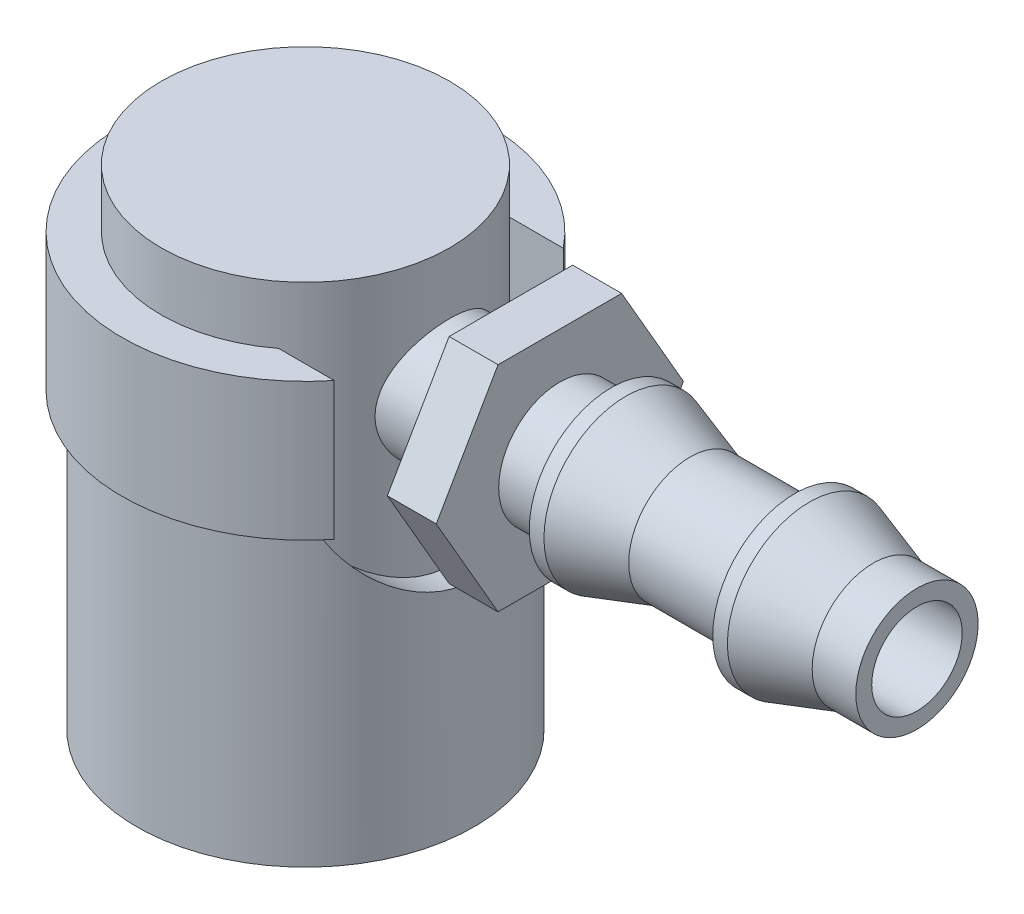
ISO-10303-21;
HEADER;
FILE_DESCRIPTION(('STEP AP214'),'2;1');
FILE_NAME('part.step','',(''),(''),'','','');
FILE_SCHEMA(('AUTOMOTIVE_DESIGN { 1 0 10303 214 1 1 1 1 }'));
ENDSEC;
DATA;
#1=APPLICATION_CONTEXT('core data for automotive mechanical design processes');
#2=APPLICATION_PROTOCOL_DEFINITION('international standard','automotive_design',2000,#1);
#3=PRODUCT_CONTEXT('',#1,'mechanical');
#4=PRODUCT('Part','Part','',(#3));
#5=PRODUCT_RELATED_PRODUCT_CATEGORY('part','',(#4));
#6=PRODUCT_DEFINITION_FORMATION('','',#4);
#7=PRODUCT_DEFINITION_CONTEXT('part definition',#1,'design');
#8=PRODUCT_DEFINITION('design','',#6,#7);
#9=PRODUCT_DEFINITION_SHAPE('','',#8);
#10=(LENGTH_UNIT() NAMED_UNIT(*) SI_UNIT(.MILLI.,.METRE.));
#11=(NAMED_UNIT(*) PLANE_ANGLE_UNIT() SI_UNIT($,.RADIAN.));
#12=(NAMED_UNIT(*) SI_UNIT($,.STERADIAN.) SOLID_ANGLE_UNIT());
#13=UNCERTAINTY_MEASURE_WITH_UNIT(LENGTH_MEASURE(1.E-05),#10,'distance_accuracy_value','');
#14=(GEOMETRIC_REPRESENTATION_CONTEXT(3) GLOBAL_UNCERTAINTY_ASSIGNED_CONTEXT((#13)) GLOBAL_UNIT_ASSIGNED_CONTEXT((#10,
#11,#12)) REPRESENTATION_CONTEXT('',''));
#15=CARTESIAN_POINT('',(0.,0.,0.));
#16=DIRECTION('',(0.,0.,1.));
#17=DIRECTION('',(1.,0.,0.));
#18=AXIS2_PLACEMENT_3D('',#15,#16,#17);
#19=CARTESIAN_POINT('',(0.,4.23463105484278,0.));
#20=DIRECTION('',(0.,1.,0.));
#21=DIRECTION('',(0.,0.,1.));
#22=AXIS2_PLACEMENT_3D('',#19,#20,#21);
#23=CYLINDRICAL_SURFACE('',#22,5.0546);
#24=CARTESIAN_POINT('',(0.,3.175,0.));
#25=DIRECTION('',(0.,1.,0.));
#26=DIRECTION('',(0.,0.,1.));
#27=AXIS2_PLACEMENT_3D('',#24,#25,#26);
#28=CIRCLE('',#27,5.0546);
#29=CARTESIAN_POINT('',(0.,3.175,5.0546));
#30=VERTEX_POINT('',#29);
#31=EDGE_CURVE('E54',#30,#30,#28,.T.);
#32=ORIENTED_EDGE('',*,*,#31,.F.);
#33=EDGE_LOOP('',(#32));
#34=FACE_BOUND('',#33,.T.);
#35=CARTESIAN_POINT('',(0.,-1.27,0.));
#36=DIRECTION('',(0.,1.,0.));
#37=DIRECTION('',(0.,0.,1.));
#38=AXIS2_PLACEMENT_3D('',#35,#36,#37);
#39=CIRCLE('',#38,5.0546);
#40=CARTESIAN_POINT('',(0.,-1.27,5.0546));
#41=VERTEX_POINT('',#40);
#42=EDGE_CURVE('E11',#41,#41,#39,.T.);
#43=ORIENTED_EDGE('',*,*,#42,.T.);
#44=EDGE_LOOP('',(#43));
#45=FACE_BOUND('',#44,.T.);
#46=ADVANCED_FACE('F40',(#34,#45),#23,.T.);
#47=CARTESIAN_POINT('',(5.0546,-1.27,0.));
#48=DIRECTION('',(0.,1.,0.));
#49=DIRECTION('',(0.,0.,1.));
#50=AXIS2_PLACEMENT_3D('',#47,#48,#49);
#51=PLANE('',#50);
#52=ORIENTED_EDGE('',*,*,#42,.F.);
#53=EDGE_LOOP('',(#52));
#54=FACE_BOUND('',#53,.T.);
#55=CARTESIAN_POINT('',(0.,-1.27,0.));
#56=DIRECTION('',(0.,1.,0.));
#57=DIRECTION('',(0.,0.,1.));
#58=AXIS2_PLACEMENT_3D('',#55,#56,#57);
#59=CIRCLE('',#58,3.5687);
#60=CARTESIAN_POINT('',(0.,-1.27,3.5687));
#61=VERTEX_POINT('',#60);
#62=EDGE_CURVE('E46',#61,#61,#59,.T.);
#63=ORIENTED_EDGE('',*,*,#62,.T.);
#64=EDGE_LOOP('',(#63));
#65=FACE_BOUND('',#64,.T.);
#66=ADVANCED_FACE('F63',(#54,#65),#51,.F.);
#67=CARTESIAN_POINT('',(0.,4.23463105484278,0.));
#68=DIRECTION('',(0.,1.,0.));
#69=DIRECTION('',(0.,0.,1.));
#70=AXIS2_PLACEMENT_3D('',#67,#68,#69);
#71=CYLINDRICAL_SURFACE('',#70,3.5687);
#72=ORIENTED_EDGE('',*,*,#62,.F.);
#73=EDGE_LOOP('',(#72));
#74=FACE_BOUND('',#73,.T.);
#75=CARTESIAN_POINT('',(0.,3.175,0.));
#76=DIRECTION('',(0.,1.,0.));
#77=DIRECTION('',(0.,0.,1.));
#78=AXIS2_PLACEMENT_3D('',#75,#76,#77);
#79=CIRCLE('',#78,3.5687);
#80=CARTESIAN_POINT('',(0.,3.175,3.5687));
#81=VERTEX_POINT('',#80);
#82=EDGE_CURVE('E50',#81,#81,#79,.T.);
#83=ORIENTED_EDGE('',*,*,#82,.T.);
#84=EDGE_LOOP('',(#83));
#85=FACE_BOUND('',#84,.T.);
#86=ADVANCED_FACE('F67',(#74,#85),#71,.F.);
#87=CARTESIAN_POINT('',(3.5687,3.175,0.));
#88=DIRECTION('',(0.,-1.,0.));
#89=DIRECTION('',(0.,0.,-1.));
#90=AXIS2_PLACEMENT_3D('',#87,#88,#89);
#91=PLANE('',#90);
#92=ORIENTED_EDGE('',*,*,#82,.F.);
#93=EDGE_LOOP('',(#92));
#94=FACE_BOUND('',#93,.T.);
#95=ORIENTED_EDGE('',*,*,#31,.T.);
#96=EDGE_LOOP('',(#95));
#97=FACE_BOUND('',#96,.T.);
#98=ADVANCED_FACE('F60',(#94,#97),#91,.F.);
#99=CLOSED_SHELL('',(#46,#66,#86,#98));
#100=MANIFOLD_SOLID_BREP('B2',#99);
#101=CARTESIAN_POINT('',(-48.3154717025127,9.525,0.));
#102=DIRECTION('',(-1.,0.,0.));
#103=DIRECTION('',(0.,0.,1.));
#104=AXIS2_PLACEMENT_3D('',#101,#102,#103);
#105=CYLINDRICAL_SURFACE('',#104,3.175);
#106=CARTESIAN_POINT('',(6.7870777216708,9.525,3.175));
#107=CARTESIAN_POINT('',(6.78707864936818,9.60956062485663,3.17499902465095));
#108=CARTESIAN_POINT('',(6.78866528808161,9.6941535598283,3.17161461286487));
#109=CARTESIAN_POINT('',(6.79494972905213,9.86270043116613,3.15812464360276));
#110=CARTESIAN_POINT('',(6.79964951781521,9.94665392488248,3.14801479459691));
#111=CARTESIAN_POINT('',(6.81823694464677,10.1969343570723,3.10767530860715));
#112=CARTESIAN_POINT('',(6.83661201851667,10.3614428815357,3.06743608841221));
#113=CARTESIAN_POINT('',(6.88284267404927,10.6799737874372,2.96222057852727));
#114=CARTESIAN_POINT('',(6.91065866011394,10.834036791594,2.89734747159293));
#115=CARTESIAN_POINT('',(6.97256824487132,11.1290875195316,2.74501078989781));
#116=CARTESIAN_POINT('',(7.00666050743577,11.2700780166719,2.65755202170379));
#117=CARTESIAN_POINT('',(7.07973875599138,11.5440962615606,2.45650563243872));
#118=CARTESIAN_POINT('',(7.11889427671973,11.6761777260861,2.34169010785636));
#119=CARTESIAN_POINT('',(7.19629564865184,11.9199158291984,2.09176603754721));
#120=CARTESIAN_POINT('',(7.23454113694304,12.0315644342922,1.95664954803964));
#121=CARTESIAN_POINT('',(7.307885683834,12.2361458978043,1.66247459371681));
#122=CARTESIAN_POINT('',(7.34276486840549,12.3280068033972,1.50261085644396));
#123=CARTESIAN_POINT('',(7.40336288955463,12.4831205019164,1.16795316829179));
#124=CARTESIAN_POINT('',(7.42908592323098,12.5463864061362,0.993166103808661));
#125=CARTESIAN_POINT('',(7.46726993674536,12.6390620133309,0.643559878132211));
#126=CARTESIAN_POINT('',(7.48036785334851,12.6701046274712,0.469244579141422));
#127=CARTESIAN_POINT('',(7.49414449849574,12.7027368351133,0.117420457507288));
#128=CARTESIAN_POINT('',(7.49482844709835,12.7043388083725,-0.0600869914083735));
#129=CARTESIAN_POINT('',(7.48406955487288,12.6788825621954,-0.401353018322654));
#130=CARTESIAN_POINT('',(7.47338678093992,12.6536207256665,-0.56527410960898));
#131=CARTESIAN_POINT('',(7.44214690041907,12.5782437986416,-0.886294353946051));
#132=CARTESIAN_POINT('',(7.42158906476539,12.5281268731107,-1.04339300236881));
#133=CARTESIAN_POINT('',(7.37218247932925,12.4038779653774,-1.34920511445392));
#134=CARTESIAN_POINT('',(7.34321174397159,12.3293904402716,-1.49775360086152));
#135=CARTESIAN_POINT('',(7.27979676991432,12.1588704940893,-1.78063289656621));
#136=CARTESIAN_POINT('',(7.24535057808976,12.0628303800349,-1.91495860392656));
#137=CARTESIAN_POINT('',(7.17147481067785,11.8438360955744,-2.17593769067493));
#138=CARTESIAN_POINT('',(7.13186499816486,11.7194348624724,-2.30132751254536));
#139=CARTESIAN_POINT('',(7.05398172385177,11.4513115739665,-2.53002310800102));
#140=CARTESIAN_POINT('',(7.015708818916,11.3075815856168,-2.63331976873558));
#141=CARTESIAN_POINT('',(6.94351973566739,10.9985494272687,-2.81829904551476));
#142=CARTESIAN_POINT('',(6.909802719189,10.8326686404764,-2.89909948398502));
#143=CARTESIAN_POINT('',(6.85293468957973,10.4878478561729,-3.03109907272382));
#144=CARTESIAN_POINT('',(6.82977582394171,10.3089176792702,-3.08232022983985));
#145=CARTESIAN_POINT('',(6.79861282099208,9.95575461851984,-3.15043387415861));
#146=CARTESIAN_POINT('',(6.78970415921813,9.78199929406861,-3.16938076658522));
#147=CARTESIAN_POINT('',(6.7854613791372,9.43360090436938,-3.17845954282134));
#148=CARTESIAN_POINT('',(6.79012229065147,9.25895818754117,-3.16860197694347));
#149=CARTESIAN_POINT('',(6.81155639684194,8.92612078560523,-3.12222809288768));
#150=CARTESIAN_POINT('',(6.82749452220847,8.76760949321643,-3.08754792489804));
#151=CARTESIAN_POINT('',(6.86860662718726,8.45879771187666,-2.99496876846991));
#152=CARTESIAN_POINT('',(6.89378281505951,8.30849919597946,-2.93706422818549));
#153=CARTESIAN_POINT('',(6.95185155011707,8.01314320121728,-2.79692330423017));
#154=CARTESIAN_POINT('',(6.98502955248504,7.86858965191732,-2.71374701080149));
#155=CARTESIAN_POINT('',(7.05497045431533,7.59478181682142,-2.52634800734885));
#156=CARTESIAN_POINT('',(7.09173493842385,7.4655343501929,-2.42211597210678));
#157=CARTESIAN_POINT('',(7.1684650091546,7.21460256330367,-2.18515993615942));
#158=CARTESIAN_POINT('',(7.2084378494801,7.09448731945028,-2.05076997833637));
#159=CARTESIAN_POINT('',(7.28420338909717,6.8782147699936,-1.76283014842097));
#160=CARTESIAN_POINT('',(7.31999571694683,6.7820595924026,-1.60927857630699));
#161=CARTESIAN_POINT('',(7.38365666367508,6.61641870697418,-1.28602845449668));
#162=CARTESIAN_POINT('',(7.41149368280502,6.54703898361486,-1.11626898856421));
#163=CARTESIAN_POINT('',(7.45582809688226,6.4383455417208,-0.766000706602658));
#164=CARTESIAN_POINT('',(7.47233249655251,6.39901324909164,-0.585498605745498));
#165=CARTESIAN_POINT('',(7.49131146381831,6.35392799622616,-0.232868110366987));
#166=CARTESIAN_POINT('',(7.49470902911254,6.34596503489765,-0.0610701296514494));
#167=CARTESIAN_POINT('',(7.48967172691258,6.35785732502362,0.281363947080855));
#168=CARTESIAN_POINT('',(7.481239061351,6.3777073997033,0.452000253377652));
#169=CARTESIAN_POINT('',(7.4539823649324,6.44307548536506,0.780636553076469));
#170=CARTESIAN_POINT('',(7.43556117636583,6.48759981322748,0.938870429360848));
#171=CARTESIAN_POINT('',(7.39037928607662,6.59994980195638,1.24554835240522));
#172=CARTESIAN_POINT('',(7.36361702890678,6.66777980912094,1.39399056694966));
#173=CARTESIAN_POINT('',(7.30281632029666,6.82825028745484,1.68431634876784));
#174=CARTESIAN_POINT('',(7.26850231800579,6.92187878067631,1.82559464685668));
#175=CARTESIAN_POINT('',(7.19663244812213,7.12987874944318,2.09104577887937));
#176=CARTESIAN_POINT('',(7.15907533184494,7.24425823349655,2.21521197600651));
#177=CARTESIAN_POINT('',(7.0816031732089,7.50001318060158,2.45205115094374));
#178=CARTESIAN_POINT('',(7.04170933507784,7.64272619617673,2.56328913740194));
#179=CARTESIAN_POINT('',(6.96676697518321,7.94610168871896,2.76050532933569));
#180=CARTESIAN_POINT('',(6.93172122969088,8.1067743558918,2.84646909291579));
#181=CARTESIAN_POINT('',(6.88622886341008,8.35773267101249,2.95404814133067));
#182=CARTESIAN_POINT('',(6.87225492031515,8.44295044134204,2.98632435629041));
#183=CARTESIAN_POINT('',(6.84711638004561,8.61620730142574,3.04352200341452));
#184=CARTESIAN_POINT('',(6.83595039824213,8.70424497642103,3.06844706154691));
#185=CARTESIAN_POINT('',(6.81687318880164,8.88223326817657,3.11059850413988));
#186=CARTESIAN_POINT('',(6.80895338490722,8.97217817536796,3.12784518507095));
#187=CARTESIAN_POINT('',(6.7966419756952,9.15341437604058,3.15450874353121));
#188=CARTESIAN_POINT('',(6.79224765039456,9.2447045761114,3.16393165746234));
#189=CARTESIAN_POINT('',(6.78882825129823,9.36766176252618,3.171255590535));
#190=CARTESIAN_POINT('',(6.78817230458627,9.3991079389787,3.17265927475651));
#191=CARTESIAN_POINT('',(6.78729686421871,9.46203458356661,3.17453166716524));
#192=CARTESIAN_POINT('',(6.78707737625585,9.49351505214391,3.17500036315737));
#193=CARTESIAN_POINT('',(6.7870777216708,9.525,3.175));
#194=B_SPLINE_CURVE_WITH_KNOTS('',3,(#106,#107,#108,#109,#110,#111,#112,#113,#114,#115,#116,
#117,#118,#119,#120,#121,#122,#123,#124,#125,#126,#127,#128,#129,#130,#131,#132,#133,#134,#135,
#136,#137,#138,#139,#140,#141,#142,#143,#144,#145,#146,#147,#148,#149,#150,#151,#152,#153,#154,
#155,#156,#157,#158,#159,#160,#161,#162,#163,#164,#165,#166,#167,#168,#169,#170,#171,#172,#173,
#174,#175,#176,#177,#178,#179,#180,#181,#182,#183,#184,#185,#186,#187,#188,#189,#190,#191,#192,
#193),.UNSPECIFIED.,.T.,.F.,(4,2,2,2,2,2,2,2,2,2,2,2,2,2,2,2,2,2,2,2,2,2,2,2,2,2,2,2,2,2,2,2,2,
2,2,2,2,2,2,2,2,2,2,4),(0.,0.253646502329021,0.507455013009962,1.01577742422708,
1.52199372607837,2.02810238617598,2.56377612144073,3.09966001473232,3.65972675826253,
4.21953644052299,4.74934075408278,5.27892228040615,5.77519322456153,6.27150081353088,
6.77539847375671,7.27947628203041,7.82012319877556,8.3609926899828,8.92077662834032,
9.48014355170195,10.0023519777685,10.5243691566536,11.011303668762,11.4983546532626,
12.0063666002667,12.514604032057,13.0659106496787,13.6172662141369,14.1707823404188,
14.7239560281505,15.2373767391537,15.750701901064,16.2447164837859,16.7388232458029,
17.2554004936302,17.7721775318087,18.3255223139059,18.8791826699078,19.1554422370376,
19.4315653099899,19.7069541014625,19.9821302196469,20.076570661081,20.1710123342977),.UNSPECIFIED.);
#195=CARTESIAN_POINT('',(6.7870777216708,9.525,3.175));
#196=VERTEX_POINT('',#195);
#197=EDGE_CURVE('E105',#196,#196,#194,.T.);
#198=ORIENTED_EDGE('',*,*,#197,.F.);
#199=EDGE_LOOP('',(#198));
#200=FACE_BOUND('',#199,.T.);
#201=CARTESIAN_POINT('',(10.668,9.525,0.));
#202=DIRECTION('',(1.,0.,0.));
#203=DIRECTION('',(0.,0.,-1.));
#204=AXIS2_PLACEMENT_3D('',#201,#202,#203);
#205=CIRCLE('',#204,3.175);
#206=CARTESIAN_POINT('',(10.668,9.525,-3.175));
#207=VERTEX_POINT('',#206);
#208=EDGE_CURVE('E38',#207,#207,#205,.T.);
#209=ORIENTED_EDGE('',*,*,#208,.F.);
#210=EDGE_LOOP('',(#209));
#211=FACE_BOUND('',#210,.T.);
#212=ADVANCED_FACE('F101',(#200,#211),#105,.T.);
#213=CARTESIAN_POINT('',(0.,0.,0.));
#214=DIRECTION('',(0.,-1.,0.));
#215=DIRECTION('',(0.,0.,-1.));
#216=AXIS2_PLACEMENT_3D('',#213,#214,#215);
#217=CYLINDRICAL_SURFACE('',#216,7.493);
#218=CARTESIAN_POINT('',(4.55653983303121,5.715,-5.94836059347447));
#219=CARTESIAN_POINT('',(4.60248726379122,5.62083335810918,-5.91316960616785));
#220=CARTESIAN_POINT('',(4.64989643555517,5.52815932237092,-5.87600303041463));
#221=CARTESIAN_POINT('',(4.7469949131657,5.34570370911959,-5.79784076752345));
#222=CARTESIAN_POINT('',(4.79668348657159,5.25592121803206,-5.7568463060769));
#223=CARTESIAN_POINT('',(4.94816247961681,4.99083580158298,-5.62834233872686));
#224=CARTESIAN_POINT('',(5.05244752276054,4.81963307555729,-5.53525121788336));
#225=CARTESIAN_POINT('',(5.26477829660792,4.48612394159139,-5.33374367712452));
#226=CARTESIAN_POINT('',(5.3728506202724,4.32391942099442,-5.22518793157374));
#227=CARTESIAN_POINT('',(5.58880213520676,4.01001731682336,-4.99353825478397));
#228=CARTESIAN_POINT('',(5.69668127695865,3.85832213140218,-4.8704410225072));
#229=CARTESIAN_POINT('',(5.90951955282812,3.56601506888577,-4.60987006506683));
#230=CARTESIAN_POINT('',(6.01448213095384,3.42538972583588,-4.47241429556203));
#231=CARTESIAN_POINT('',(6.2192818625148,3.15580666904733,-4.18294326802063));
#232=CARTESIAN_POINT('',(6.31911891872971,3.02684917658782,-4.03092773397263));
#233=CARTESIAN_POINT('',(6.51095021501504,2.78234344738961,-3.713071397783));
#234=CARTESIAN_POINT('',(6.60297492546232,2.66674241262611,-3.5472898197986));
#235=CARTESIAN_POINT('',(6.77725659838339,2.44998636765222,-3.20175458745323));
#236=CARTESIAN_POINT('',(6.8595184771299,2.34882408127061,-3.02200804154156));
#237=CARTESIAN_POINT('',(6.98737824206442,2.1927451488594,-2.7092930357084));
#238=CARTESIAN_POINT('',(7.0362639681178,2.1334132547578,-2.57985111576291));
#239=CARTESIAN_POINT('',(7.12767141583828,2.02293197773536,-2.3153639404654));
#240=CARTESIAN_POINT('',(7.1701948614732,1.97178037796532,-2.1803202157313));
#241=CARTESIAN_POINT('',(7.24813864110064,1.87832274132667,-1.90524645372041));
#242=CARTESIAN_POINT('',(7.28356096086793,1.83601423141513,-1.76521782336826));
#243=CARTESIAN_POINT('',(7.34664086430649,1.76085034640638,-1.48091688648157));
#244=CARTESIAN_POINT('',(7.37429820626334,1.72799526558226,-1.33664444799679));
#245=CARTESIAN_POINT('',(7.4214054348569,1.67212396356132,-1.04397531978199));
#246=CARTESIAN_POINT('',(7.44080612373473,1.64916670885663,-0.895559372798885));
#247=CARTESIAN_POINT('',(7.47072325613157,1.61379489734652,-0.59658256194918));
#248=CARTESIAN_POINT('',(7.48123972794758,1.6013803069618,-0.446021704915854));
#249=CARTESIAN_POINT('',(7.49313815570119,1.58733587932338,-0.144065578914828));
#250=CARTESIAN_POINT('',(7.49452190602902,1.58570392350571,0.00732952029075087));
#251=CARTESIAN_POINT('',(7.48812541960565,1.59325240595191,0.309648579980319));
#252=CARTESIAN_POINT('',(7.48034575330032,1.60243217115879,0.460572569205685));
#253=CARTESIAN_POINT('',(7.45692617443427,1.63010377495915,0.747023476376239));
#254=CARTESIAN_POINT('',(7.44206352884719,1.64767508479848,0.882704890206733));
#255=CARTESIAN_POINT('',(7.40519873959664,1.69133668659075,1.15174814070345));
#256=CARTESIAN_POINT('',(7.38319421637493,1.71742981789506,1.2851091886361));
#257=CARTESIAN_POINT('',(7.33245119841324,1.77774692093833,1.54861204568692));
#258=CARTESIAN_POINT('',(7.30371534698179,1.81196770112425,1.67875509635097));
#259=CARTESIAN_POINT('',(7.23998919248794,1.88809304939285,1.93522529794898));
#260=CARTESIAN_POINT('',(7.2049965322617,1.9300005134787,2.06155098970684));
#261=CARTESIAN_POINT('',(7.08759653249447,2.07112799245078,2.44646656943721));
#262=CARTESIAN_POINT('',(6.99537509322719,2.18268268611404,2.69768841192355));
#263=CARTESIAN_POINT('',(6.79098054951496,2.43294761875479,3.17739409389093));
#264=CARTESIAN_POINT('',(6.67878930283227,2.57168256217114,3.40585696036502));
#265=CARTESIAN_POINT('',(6.47059687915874,2.83351708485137,3.782874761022));
#266=CARTESIAN_POINT('',(6.37784534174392,2.95147115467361,3.93687595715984));
#267=CARTESIAN_POINT('',(6.18638249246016,3.19883732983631,4.23137813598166));
#268=CARTESIAN_POINT('',(6.08767089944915,3.32824997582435,4.37187848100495));
#269=CARTESIAN_POINT('',(5.88624749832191,3.597754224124,4.63952952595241));
#270=CARTESIAN_POINT('',(5.78353039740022,3.73786020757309,4.76666168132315));
#271=CARTESIAN_POINT('',(5.57639918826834,4.02802121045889,5.00739560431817));
#272=CARTESIAN_POINT('',(5.47198547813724,4.17807392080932,5.12100049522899));
#273=CARTESIAN_POINT('',(5.29680105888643,4.43897173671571,5.30088255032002));
#274=CARTESIAN_POINT('',(5.22582984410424,4.54721530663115,5.37076785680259));
#275=CARTESIAN_POINT('',(5.08516816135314,4.76832710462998,5.50413518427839));
#276=CARTESIAN_POINT('',(5.0154772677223,4.88119375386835,5.56761936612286));
#277=CARTESIAN_POINT('',(4.87868495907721,5.1112685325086,5.68785708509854));
#278=CARTESIAN_POINT('',(4.81157444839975,5.22845786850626,5.74463607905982));
#279=CARTESIAN_POINT('',(4.68097911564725,5.46789588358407,5.85155393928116));
#280=CARTESIAN_POINT('',(4.61749690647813,5.59014810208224,5.90168805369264));
#281=CARTESIAN_POINT('',(4.55653983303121,5.715,5.94836059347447));
#282=B_SPLINE_CURVE_WITH_KNOTS('',3,(#218,#219,#220,#221,#222,#223,#224,#225,#226,#227,#228,
#229,#230,#231,#232,#233,#234,#235,#236,#237,#238,#239,#240,#241,#242,#243,#244,#245,#246,#247,
#248,#249,#250,#251,#252,#253,#254,#255,#256,#257,#258,#259,#260,#261,#262,#263,#264,#265,#266,
#267,#268,#269,#270,#271,#272,#273,#274,#275,#276,#277,#278,#279,#280,#281),.UNSPECIFIED.,.F.,
.F.,(4,2,2,2,2,2,2,2,2,2,2,2,2,2,2,2,2,2,2,2,2,2,2,2,2,2,2,2,2,2,2,4),(0.,0.331496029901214,
0.662886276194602,1.32509548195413,1.99370016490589,2.66245691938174,3.33038716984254,
3.99833008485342,4.66353509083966,5.32840368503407,5.77964574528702,6.23076531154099,
6.6817585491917,7.1327658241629,7.58642405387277,8.04008083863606,8.49364848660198,
8.94718790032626,9.3595744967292,9.77209863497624,10.1844610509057,10.5969791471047,
11.4632801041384,12.33037213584,12.974613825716,13.6188859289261,14.2640403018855,
14.9090454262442,15.3501422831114,15.7910897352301,16.2303052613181,16.6698332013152),.UNSPECIFIED.);
#283=CARTESIAN_POINT('',(4.55653983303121,5.715,-5.94836059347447));
#284=VERTEX_POINT('',#283);
#285=CARTESIAN_POINT('',(4.5565398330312,5.715,5.94836059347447));
#286=VERTEX_POINT('',#285);
#287=EDGE_CURVE('E691',#284,#286,#282,.T.);
#288=ORIENTED_EDGE('',*,*,#287,.F.);
#289=DIRECTION('',(0.,-1.,0.));
#290=VECTOR('',#289,1.);
#291=CARTESIAN_POINT('',(4.5565398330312,12.85875,-5.94836059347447));
#292=LINE('',#291,#290);
#293=CARTESIAN_POINT('',(4.5565398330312,12.85875,-5.94836059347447));
#294=VERTEX_POINT('',#293);
#295=EDGE_CURVE('E751',#294,#284,#292,.T.);
#296=ORIENTED_EDGE('',*,*,#295,.F.);
#297=CARTESIAN_POINT('',(0.,12.85875,0.));
#298=DIRECTION('',(0.,-1.,0.));
#299=DIRECTION('',(0.,0.,1.));
#300=AXIS2_PLACEMENT_3D('',#297,#298,#299);
#301=CIRCLE('',#300,7.493);
#302=CARTESIAN_POINT('',(4.5565398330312,12.85875,5.94836059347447));
#303=VERTEX_POINT('',#302);
#304=EDGE_CURVE('E758',#303,#294,#301,.T.);
#305=ORIENTED_EDGE('',*,*,#304,.F.);
#306=DIRECTION('',(0.,-1.,0.));
#307=VECTOR('',#306,1.);
#308=CARTESIAN_POINT('',(4.5565398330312,12.85875,5.94836059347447));
#309=LINE('',#308,#307);
#310=EDGE_CURVE('E372',#303,#286,#309,.T.);
#311=ORIENTED_EDGE('',*,*,#310,.T.);
#312=EDGE_LOOP('',(#288,#296,#305,#311));
#313=FACE_BOUND('',#312,.T.);
#314=CARTESIAN_POINT('',(0.,15.875,0.));
#315=DIRECTION('',(0.,-1.,0.));
#316=DIRECTION('',(0.,0.,-1.));
#317=AXIS2_PLACEMENT_3D('',#314,#315,#316);
#318=CIRCLE('',#317,7.493);
#319=CARTESIAN_POINT('',(0.,15.875,-7.493));
#320=VERTEX_POINT('',#319);
#321=EDGE_CURVE('E115',#320,#320,#318,.T.);
#322=ORIENTED_EDGE('',*,*,#321,.T.);
#323=EDGE_LOOP('',(#322));
#324=FACE_BOUND('',#323,.T.);
#325=ORIENTED_EDGE('',*,*,#197,.T.);
#326=EDGE_LOOP('',(#325));
#327=FACE_BOUND('',#326,.T.);
#328=ADVANCED_FACE('F276',(#313,#324,#327),#217,.T.);
#329=CARTESIAN_POINT('',(0.,15.875,0.));
#330=DIRECTION('',(0.,1.,0.));
#331=DIRECTION('',(0.,0.,1.));
#332=AXIS2_PLACEMENT_3D('',#329,#330,#331);
#333=PLANE('',#332);
#334=ORIENTED_EDGE('',*,*,#321,.F.);
#335=EDGE_LOOP('',(#334));
#336=FACE_BOUND('',#335,.T.);
#337=ADVANCED_FACE('F103',(#336),#333,.T.);
#338=CARTESIAN_POINT('',(7.493,-9.525,0.));
#339=DIRECTION('',(0.,-1.,0.));
#340=DIRECTION('',(0.,0.,-1.));
#341=AXIS2_PLACEMENT_3D('',#338,#339,#340);
#342=PLANE('',#341);
#343=CARTESIAN_POINT('',(0.,-9.525,0.));
#344=DIRECTION('',(0.,-1.,0.));
#345=DIRECTION('',(0.,0.,-1.));
#346=AXIS2_PLACEMENT_3D('',#343,#344,#345);
#347=CIRCLE('',#346,4.7625);
#348=CARTESIAN_POINT('',(0.,-9.525,-4.7625));
#349=VERTEX_POINT('',#348);
#350=EDGE_CURVE('E271',#349,#349,#347,.T.);
#351=ORIENTED_EDGE('',*,*,#350,.F.);
#352=EDGE_LOOP('',(#351));
#353=FACE_BOUND('',#352,.T.);
#354=CARTESIAN_POINT('',(0.,-9.525,0.));
#355=DIRECTION('',(0.,-1.,0.));
#356=DIRECTION('',(0.,0.,-1.));
#357=AXIS2_PLACEMENT_3D('',#354,#355,#356);
#358=CIRCLE('',#357,8.763);
#359=CARTESIAN_POINT('',(0.,-9.525,-8.763));
#360=VERTEX_POINT('',#359);
#361=EDGE_CURVE('E686',#360,#360,#358,.T.);
#362=ORIENTED_EDGE('',*,*,#361,.T.);
#363=EDGE_LOOP('',(#362));
#364=FACE_BOUND('',#363,.T.);
#365=ADVANCED_FACE('F280',(#353,#364),#342,.T.);
#366=CARTESIAN_POINT('',(0.,0.,0.));
#367=DIRECTION('',(0.,-1.,0.));
#368=DIRECTION('',(0.,0.,-1.));
#369=AXIS2_PLACEMENT_3D('',#366,#367,#368);
#370=CYLINDRICAL_SURFACE('',#369,4.7625);
#371=ORIENTED_EDGE('',*,*,#350,.T.);
#372=EDGE_LOOP('',(#371));
#373=FACE_BOUND('',#372,.T.);
#374=CARTESIAN_POINT('',(0.,-1.397,0.));
#375=DIRECTION('',(0.,-1.,0.));
#376=DIRECTION('',(0.,0.,-1.));
#377=AXIS2_PLACEMENT_3D('',#374,#375,#376);
#378=CIRCLE('',#377,4.7625);
#379=CARTESIAN_POINT('',(0.,-1.397,-4.7625));
#380=VERTEX_POINT('',#379);
#381=EDGE_CURVE('E268',#380,#380,#378,.T.);
#382=ORIENTED_EDGE('',*,*,#381,.F.);
#383=EDGE_LOOP('',(#382));
#384=FACE_BOUND('',#383,.T.);
#385=ADVANCED_FACE('F285',(#373,#384),#370,.F.);
#386=CARTESIAN_POINT('',(0.,-1.22835598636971,0.));
#387=DIRECTION('',(0.,1.,0.));
#388=DIRECTION('',(0.,0.,1.));
#389=AXIS2_PLACEMENT_3D('',#386,#387,#388);
#390=CONICAL_SURFACE('',#389,5.0546,1.0471975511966);
#391=ORIENTED_EDGE('',*,*,#381,.T.);
#392=EDGE_LOOP('',(#391));
#393=FACE_BOUND('',#392,.T.);
#394=CARTESIAN_POINT('',(0.,-1.22835598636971,0.));
#395=DIRECTION('',(0.,-1.,0.));
#396=DIRECTION('',(0.,0.,-1.));
#397=AXIS2_PLACEMENT_3D('',#394,#395,#396);
#398=CIRCLE('',#397,5.0546);
#399=CARTESIAN_POINT('',(0.,-1.22835598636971,-5.0546));
#400=VERTEX_POINT('',#399);
#401=EDGE_CURVE('E265',#400,#400,#398,.T.);
#402=ORIENTED_EDGE('',*,*,#401,.F.);
#403=EDGE_LOOP('',(#402));
#404=FACE_BOUND('',#403,.T.);
#405=ADVANCED_FACE('F633',(#393,#404),#390,.F.);
#406=CARTESIAN_POINT('',(0.,0.,0.));
#407=DIRECTION('',(0.,-1.,0.));
#408=DIRECTION('',(0.,0.,-1.));
#409=AXIS2_PLACEMENT_3D('',#406,#407,#408);
#410=CYLINDRICAL_SURFACE('',#409,5.0546);
#411=ORIENTED_EDGE('',*,*,#401,.T.);
#412=EDGE_LOOP('',(#411));
#413=FACE_BOUND('',#412,.T.);
#414=CARTESIAN_POINT('',(0.,3.175,0.));
#415=DIRECTION('',(0.,-1.,0.));
#416=DIRECTION('',(0.,0.,-1.));
#417=AXIS2_PLACEMENT_3D('',#414,#415,#416);
#418=CIRCLE('',#417,5.0546);
#419=CARTESIAN_POINT('',(0.,3.175,-5.0546));
#420=VERTEX_POINT('',#419);
#421=EDGE_CURVE('E262',#420,#420,#418,.T.);
#422=ORIENTED_EDGE('',*,*,#421,.F.);
#423=EDGE_LOOP('',(#422));
#424=FACE_BOUND('',#423,.T.);
#425=ADVANCED_FACE('F624',(#413,#424),#410,.F.);
#426=CARTESIAN_POINT('',(5.0546,3.175,0.));
#427=DIRECTION('',(0.,-1.,0.));
#428=DIRECTION('',(0.,0.,-1.));
#429=AXIS2_PLACEMENT_3D('',#426,#427,#428);
#430=PLANE('',#429);
#431=ORIENTED_EDGE('',*,*,#421,.T.);
#432=EDGE_LOOP('',(#431));
#433=FACE_BOUND('',#432,.T.);
#434=CARTESIAN_POINT('',(0.,3.175,0.));
#435=DIRECTION('',(0.,-1.,0.));
#436=DIRECTION('',(0.,0.,-1.));
#437=AXIS2_PLACEMENT_3D('',#434,#435,#436);
#438=CIRCLE('',#437,3.5687);
#439=CARTESIAN_POINT('',(0.,3.175,-3.5687));
#440=VERTEX_POINT('',#439);
#441=EDGE_CURVE('E259',#440,#440,#438,.T.);
#442=ORIENTED_EDGE('',*,*,#441,.F.);
#443=EDGE_LOOP('',(#442));
#444=FACE_BOUND('',#443,.T.);
#445=ADVANCED_FACE('F619',(#433,#444),#430,.T.);
#446=CARTESIAN_POINT('',(0.,0.,0.));
#447=DIRECTION('',(0.,-1.,0.));
#448=DIRECTION('',(0.,0.,-1.));
#449=AXIS2_PLACEMENT_3D('',#446,#447,#448);
#450=CYLINDRICAL_SURFACE('',#449,3.5687);
#451=CARTESIAN_POINT('',(2.68616258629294,9.525,-2.3495));
#452=CARTESIAN_POINT('',(2.68617671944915,9.40986703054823,-2.34949173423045));
#453=CARTESIAN_POINT('',(2.69370213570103,9.29467679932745,-2.3409640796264));
#454=CARTESIAN_POINT('',(2.72236330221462,9.06838257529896,-2.30755329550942));
#455=CARTESIAN_POINT('',(2.74352354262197,8.95728631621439,-2.28264073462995));
#456=CARTESIAN_POINT('',(2.79572341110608,8.74312883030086,-2.21838386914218));
#457=CARTESIAN_POINT('',(2.8266697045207,8.64000270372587,-2.17917539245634));
#458=CARTESIAN_POINT('',(2.89479000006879,8.44194663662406,-2.08783499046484));
#459=CARTESIAN_POINT('',(2.93196537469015,8.34701850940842,-2.03570021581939));
#460=CARTESIAN_POINT('',(3.01509862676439,8.15232505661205,-1.91081922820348));
#461=CARTESIAN_POINT('',(3.0615347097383,8.05399685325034,-1.83614878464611));
#462=CARTESIAN_POINT('',(3.15405666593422,7.87003155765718,-1.67225579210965));
#463=CARTESIAN_POINT('',(3.2001421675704,7.78440652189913,-1.58301958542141));
#464=CARTESIAN_POINT('',(3.29437380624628,7.61635471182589,-1.37737583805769));
#465=CARTESIAN_POINT('',(3.341911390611,7.53603831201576,-1.25891462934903));
#466=CARTESIAN_POINT('',(3.40524453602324,7.43192476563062,-1.06975883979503));
#467=CARTESIAN_POINT('',(3.4250309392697,7.39994072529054,-1.00477732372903));
#468=CARTESIAN_POINT('',(3.46136721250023,7.3418575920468,-0.871388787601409));
#469=CARTESIAN_POINT('',(3.4779194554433,7.31575418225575,-0.802984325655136));
#470=CARTESIAN_POINT('',(3.50563466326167,7.27239032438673,-0.670959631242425));
#471=CARTESIAN_POINT('',(3.51718935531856,7.25447444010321,-0.607636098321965));
#472=CARTESIAN_POINT('',(3.53697007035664,7.22395171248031,-0.479246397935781));
#473=CARTESIAN_POINT('',(3.54519811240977,7.21134164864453,-0.414181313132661));
#474=CARTESIAN_POINT('',(3.55807853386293,7.19165271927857,-0.282912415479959));
#475=CARTESIAN_POINT('',(3.56273356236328,7.18456975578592,-0.216709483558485));
#476=CARTESIAN_POINT('',(3.56833698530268,7.17604975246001,-0.0838094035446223));
#477=CARTESIAN_POINT('',(3.56928588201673,7.17461194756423,-0.0171123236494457));
#478=CARTESIAN_POINT('',(3.56677485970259,7.17842106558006,0.16289865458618));
#479=CARTESIAN_POINT('',(3.5597575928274,7.18906124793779,0.276112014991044));
#480=CARTESIAN_POINT('',(3.53546570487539,7.2262525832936,0.498668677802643));
#481=CARTESIAN_POINT('',(3.51819032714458,7.25280490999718,0.608011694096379));
#482=CARTESIAN_POINT('',(3.47491172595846,7.32041068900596,0.819924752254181));
#483=CARTESIAN_POINT('',(3.44893073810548,7.36142721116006,0.922511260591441));
#484=CARTESIAN_POINT('',(3.39016802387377,7.45638728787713,1.11935232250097));
#485=CARTESIAN_POINT('',(3.35738500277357,7.51033330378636,1.21360528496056));
#486=CARTESIAN_POINT('',(3.28258920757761,7.63743377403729,1.40429011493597));
#487=CARTESIAN_POINT('',(3.2399304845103,7.71217448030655,1.4994087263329));
#488=CARTESIAN_POINT('',(3.15190482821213,7.87463610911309,1.67658248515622));
#489=CARTESIAN_POINT('',(3.10653380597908,7.96237694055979,1.75861718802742));
#490=CARTESIAN_POINT('',(3.00992000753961,8.16370551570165,1.91992027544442));
#491=CARTESIAN_POINT('',(2.95882029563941,8.27919593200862,1.9969174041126));
#492=CARTESIAN_POINT('',(2.86427840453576,8.52433996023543,2.13030929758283));
#493=CARTESIAN_POINT('',(2.82082306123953,8.65396858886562,2.18673966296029));
#494=CARTESIAN_POINT('',(2.75930512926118,8.88695185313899,2.26352931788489));
#495=CARTESIAN_POINT('',(2.73753830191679,8.98744652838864,2.28956946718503));
#496=CARTESIAN_POINT('',(2.7047630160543,9.19263045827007,2.32820435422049));
#497=CARTESIAN_POINT('',(2.69373670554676,9.29731245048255,2.34082140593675));
#498=CARTESIAN_POINT('',(2.68413840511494,9.50842748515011,2.35182583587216));
#499=CARTESIAN_POINT('',(2.68561471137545,9.61486573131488,2.35015803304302));
#500=CARTESIAN_POINT('',(2.70088835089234,9.82569480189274,2.33258299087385));
#501=CARTESIAN_POINT('',(2.71469586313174,9.93008386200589,2.31666398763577));
#502=CARTESIAN_POINT('',(2.75170095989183,10.1296836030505,2.27256120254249));
#503=CARTESIAN_POINT('',(2.77448286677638,10.225095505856,2.24491667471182));
#504=CARTESIAN_POINT('',(2.82680863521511,10.4100192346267,2.17865792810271));
#505=CARTESIAN_POINT('',(2.85635473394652,10.4995290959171,2.14004007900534));
#506=CARTESIAN_POINT('',(2.92596680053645,10.6890743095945,2.04413814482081));
#507=CARTESIAN_POINT('',(2.96695629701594,10.7876621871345,1.98466913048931));
#508=CARTESIAN_POINT('',(3.05120196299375,10.9745972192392,1.85254990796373));
#509=CARTESIAN_POINT('',(3.0944608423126,11.0629317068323,1.77988367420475));
#510=CARTESIAN_POINT('',(3.18879008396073,11.2455312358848,1.60590658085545));
#511=CARTESIAN_POINT('',(3.23963100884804,11.337260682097,1.50177896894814));
#512=CARTESIAN_POINT('',(3.3346241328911,11.5020602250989,1.27700640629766));
#513=CARTESIAN_POINT('',(3.37878273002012,11.5751482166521,1.15637746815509));
#514=CARTESIAN_POINT('',(3.44814141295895,11.6873466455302,0.925991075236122));
#515=CARTESIAN_POINT('',(3.47536011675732,11.7303061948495,0.818718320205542));
#516=CARTESIAN_POINT('',(3.52018595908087,11.8002950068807,0.597196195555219));
#517=CARTESIAN_POINT('',(3.53780112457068,11.8273375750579,0.482952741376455));
#518=CARTESIAN_POINT('',(3.56186037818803,11.8641401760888,0.250044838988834));
#519=CARTESIAN_POINT('',(3.56825901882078,11.8738299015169,0.131364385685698));
#520=CARTESIAN_POINT('',(3.56909641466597,11.8751024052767,-0.106141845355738));
#521=CARTESIAN_POINT('',(3.56353558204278,11.8666858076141,-0.224967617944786));
#522=CARTESIAN_POINT('',(3.5417729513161,11.8334252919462,-0.4511433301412));
#523=CARTESIAN_POINT('',(3.52629741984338,11.8097018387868,-0.558733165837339));
#524=CARTESIAN_POINT('',(3.48669633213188,11.7480918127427,-0.768066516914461));
#525=CARTESIAN_POINT('',(3.46256941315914,11.7102030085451,-0.869809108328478));
#526=CARTESIAN_POINT('',(3.4056615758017,11.6189002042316,-1.0718202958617));
#527=CARTESIAN_POINT('',(3.37242609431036,11.5646486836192,-1.17157903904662));
#528=CARTESIAN_POINT('',(3.30056208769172,11.4434940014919,-1.3609508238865));
#529=CARTESIAN_POINT('',(3.26193001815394,11.3765825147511,-1.45055712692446));
#530=CARTESIAN_POINT('',(3.17555408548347,11.2201651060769,-1.63189107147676));
#531=CARTESIAN_POINT('',(3.1273305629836,11.1287618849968,-1.72175473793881));
#532=CARTESIAN_POINT('',(3.03132280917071,10.932406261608,-1.8856636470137));
#533=CARTESIAN_POINT('',(2.98353886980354,10.8274454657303,-1.95969901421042));
#534=CARTESIAN_POINT('',(2.89785749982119,10.616097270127,-2.08402656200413));
#535=CARTESIAN_POINT('',(2.85944970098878,10.5108764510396,-2.13594231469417));
#536=CARTESIAN_POINT('',(2.79144330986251,10.2914689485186,-2.22409058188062));
#537=CARTESIAN_POINT('',(2.76182558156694,10.1773024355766,-2.26035724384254));
#538=CARTESIAN_POINT('',(2.72197337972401,9.97319526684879,-2.30806848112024));
#539=CARTESIAN_POINT('',(2.70868869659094,9.88478983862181,-2.32353431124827));
#540=CARTESIAN_POINT('',(2.69077980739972,9.70593406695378,-2.34425088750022));
#541=CARTESIAN_POINT('',(2.68615147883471,9.61548471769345,-2.34950649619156));
#542=CARTESIAN_POINT('',(2.68616258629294,9.525,-2.3495));
#543=B_SPLINE_CURVE_WITH_KNOTS('',3,(#451,#452,#453,#454,#455,#456,#457,#458,#459,#460,#461,
#462,#463,#464,#465,#466,#467,#468,#469,#470,#471,#472,#473,#474,#475,#476,#477,#478,#479,#480,
#481,#482,#483,#484,#485,#486,#487,#488,#489,#490,#491,#492,#493,#494,#495,#496,#497,#498,#499,
#500,#501,#502,#503,#504,#505,#506,#507,#508,#509,#510,#511,#512,#513,#514,#515,#516,#517,#518,
#519,#520,#521,#522,#523,#524,#525,#526,#527,#528,#529,#530,#531,#532,#533,#534,#535,#536,#537,
#538,#539,#540,#541,#542),.UNSPECIFIED.,.T.,.F.,(4,2,2,2,2,2,2,2,2,2,2,2,2,2,2,2,2,2,2,2,2,2,2,
2,2,2,2,2,2,2,2,2,2,2,2,2,2,2,2,2,2,2,2,2,2,4),(0.,0.3449870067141,0.690595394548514,
1.03300220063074,1.37548455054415,1.7697260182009,2.16433929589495,2.61397099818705,
2.83890726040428,3.06367785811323,3.26382756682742,3.46385561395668,3.66373521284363,
3.86358772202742,4.20355352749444,4.54354441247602,4.88267343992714,5.22186707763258,
5.60521113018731,5.98914843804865,6.43082380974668,6.87173097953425,7.18867372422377,
7.50508876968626,7.82272664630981,8.14062696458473,8.44526776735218,8.75000947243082,
9.11536280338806,9.48116279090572,9.92242228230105,10.3632565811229,10.7179125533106,
11.0722716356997,11.4280632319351,11.7838425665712,12.1161485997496,12.4485069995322,
12.8021083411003,13.155943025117,13.5651706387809,13.9746528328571,14.343658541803,
14.7118549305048,14.9831145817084,15.2542450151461),.UNSPECIFIED.);
#544=CARTESIAN_POINT('',(2.68616258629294,9.525,-2.3495));
#545=VERTEX_POINT('',#544);
#546=EDGE_CURVE('E204',#545,#545,#543,.T.);
#547=ORIENTED_EDGE('',*,*,#546,.F.);
#548=EDGE_LOOP('',(#547));
#549=FACE_BOUND('',#548,.T.);
#550=ORIENTED_EDGE('',*,*,#441,.T.);
#551=EDGE_LOOP('',(#550));
#552=FACE_BOUND('',#551,.T.);
#553=CARTESIAN_POINT('',(0.,13.1445,0.));
#554=DIRECTION('',(0.,-1.,0.));
#555=DIRECTION('',(0.,0.,-1.));
#556=AXIS2_PLACEMENT_3D('',#553,#554,#555);
#557=CIRCLE('',#556,3.5687);
#558=CARTESIAN_POINT('',(0.,13.1445,-3.5687));
#559=VERTEX_POINT('',#558);
#560=EDGE_CURVE('E256',#559,#559,#557,.T.);
#561=ORIENTED_EDGE('',*,*,#560,.F.);
#562=EDGE_LOOP('',(#561));
#563=FACE_BOUND('',#562,.T.);
#564=ADVANCED_FACE('F381',(#549,#552,#563),#450,.F.);
#565=CARTESIAN_POINT('',(3.5687,13.1445,0.));
#566=DIRECTION('',(0.,-1.,0.));
#567=DIRECTION('',(0.,0.,-1.));
#568=AXIS2_PLACEMENT_3D('',#565,#566,#567);
#569=PLANE('',#568);
#570=ORIENTED_EDGE('',*,*,#560,.T.);
#571=EDGE_LOOP('',(#570));
#572=FACE_BOUND('',#571,.T.);
#573=ADVANCED_FACE('F391',(#572),#569,.T.);
#574=CARTESIAN_POINT('',(10.668,9.525,-6.41580486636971));
#575=DIRECTION('',(1.,0.,0.));
#576=DIRECTION('',(0.,0.,-1.));
#577=AXIS2_PLACEMENT_3D('',#574,#575,#576);
#578=PLANE('',#577);
#579=DIRECTION('',(0.,0.866025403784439,-0.5));
#580=VECTOR('',#579,1.);
#581=CARTESIAN_POINT('',(10.668,3.96875,-3.20790243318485));
#582=LINE('',#581,#580);
#583=CARTESIAN_POINT('',(10.668,3.96875,-3.20790243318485));
#584=VERTEX_POINT('',#583);
#585=CARTESIAN_POINT('',(10.668,9.525,-6.41580486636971));
#586=VERTEX_POINT('',#585);
#587=EDGE_CURVE('E216',#584,#586,#582,.T.);
#588=ORIENTED_EDGE('',*,*,#587,.F.);
#589=DIRECTION('',(0.,0.,-1.));
#590=VECTOR('',#589,1.);
#591=CARTESIAN_POINT('',(10.668,3.96875,3.20790243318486));
#592=LINE('',#591,#590);
#593=CARTESIAN_POINT('',(10.668,3.96875,3.20790243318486));
#594=VERTEX_POINT('',#593);
#595=EDGE_CURVE('E190',#594,#584,#592,.T.);
#596=ORIENTED_EDGE('',*,*,#595,.F.);
#597=DIRECTION('',(0.,-0.866025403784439,-0.5));
#598=VECTOR('',#597,1.);
#599=CARTESIAN_POINT('',(10.668,9.525,6.41580486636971));
#600=LINE('',#599,#598);
#601=CARTESIAN_POINT('',(10.668,9.525,6.41580486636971));
#602=VERTEX_POINT('',#601);
#603=EDGE_CURVE('E174',#602,#594,#600,.T.);
#604=ORIENTED_EDGE('',*,*,#603,.F.);
#605=DIRECTION('',(0.,-0.866025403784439,0.5));
#606=VECTOR('',#605,1.);
#607=CARTESIAN_POINT('',(10.668,15.08125,3.20790243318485));
#608=LINE('',#607,#606);
#609=CARTESIAN_POINT('',(10.668,15.08125,3.20790243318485));
#610=VERTEX_POINT('',#609);
#611=EDGE_CURVE('E188',#610,#602,#608,.T.);
#612=ORIENTED_EDGE('',*,*,#611,.F.);
#613=DIRECTION('',(0.,0.,1.));
#614=VECTOR('',#613,1.);
#615=CARTESIAN_POINT('',(10.668,15.08125,-3.20790243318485));
#616=LINE('',#615,#614);
#617=CARTESIAN_POINT('',(10.668,15.08125,-3.20790243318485));
#618=VERTEX_POINT('',#617);
#619=EDGE_CURVE('E193',#618,#610,#616,.T.);
#620=ORIENTED_EDGE('',*,*,#619,.F.);
#621=DIRECTION('',(0.,0.866025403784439,0.5));
#622=VECTOR('',#621,1.);
#623=CARTESIAN_POINT('',(10.668,9.525,-6.41580486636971));
#624=LINE('',#623,#622);
#625=EDGE_CURVE('E195',#586,#618,#624,.T.);
#626=ORIENTED_EDGE('',*,*,#625,.F.);
#627=EDGE_LOOP('',(#588,#596,#604,#612,#620,#626));
#628=FACE_BOUND('',#627,.T.);
#629=ORIENTED_EDGE('',*,*,#208,.T.);
#630=EDGE_LOOP('',(#629));
#631=FACE_BOUND('',#630,.T.);
#632=ADVANCED_FACE('F185',(#628,#631),#578,.F.);
#633=CARTESIAN_POINT('',(13.208,9.525,-6.41580486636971));
#634=DIRECTION('',(1.,0.,0.));
#635=DIRECTION('',(0.,0.,-1.));
#636=AXIS2_PLACEMENT_3D('',#633,#634,#635);
#637=PLANE('',#636);
#638=DIRECTION('',(0.,0.866025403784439,-0.5));
#639=VECTOR('',#638,1.);
#640=CARTESIAN_POINT('',(13.208,3.96875,-3.20790243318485));
#641=LINE('',#640,#639);
#642=CARTESIAN_POINT('',(13.208,3.96875,-3.20790243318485));
#643=VERTEX_POINT('',#642);
#644=CARTESIAN_POINT('',(13.208,9.525,-6.41580486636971));
#645=VERTEX_POINT('',#644);
#646=EDGE_CURVE('E200',#643,#645,#641,.T.);
#647=ORIENTED_EDGE('',*,*,#646,.T.);
#648=DIRECTION('',(0.,0.866025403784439,0.5));
#649=VECTOR('',#648,1.);
#650=CARTESIAN_POINT('',(13.208,9.525,-6.41580486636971));
#651=LINE('',#650,#649);
#652=CARTESIAN_POINT('',(13.208,15.08125,-3.20790243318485));
#653=VERTEX_POINT('',#652);
#654=EDGE_CURVE('E203',#645,#653,#651,.T.);
#655=ORIENTED_EDGE('',*,*,#654,.T.);
#656=DIRECTION('',(0.,0.,1.));
#657=VECTOR('',#656,1.);
#658=CARTESIAN_POINT('',(13.208,15.08125,-3.20790243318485));
#659=LINE('',#658,#657);
#660=CARTESIAN_POINT('',(13.208,15.08125,3.20790243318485));
#661=VERTEX_POINT('',#660);
#662=EDGE_CURVE('E207',#653,#661,#659,.T.);
#663=ORIENTED_EDGE('',*,*,#662,.T.);
#664=DIRECTION('',(0.,-0.866025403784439,0.5));
#665=VECTOR('',#664,1.);
#666=CARTESIAN_POINT('',(13.208,15.08125,3.20790243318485));
#667=LINE('',#666,#665);
#668=CARTESIAN_POINT('',(13.208,9.525,6.41580486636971));
#669=VERTEX_POINT('',#668);
#670=EDGE_CURVE('E210',#661,#669,#667,.T.);
#671=ORIENTED_EDGE('',*,*,#670,.T.);
#672=DIRECTION('',(0.,-0.866025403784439,-0.5));
#673=VECTOR('',#672,1.);
#674=CARTESIAN_POINT('',(13.208,9.525,6.41580486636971));
#675=LINE('',#674,#673);
#676=CARTESIAN_POINT('',(13.208,3.96875,3.20790243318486));
#677=VERTEX_POINT('',#676);
#678=EDGE_CURVE('E176',#669,#677,#675,.T.);
#679=ORIENTED_EDGE('',*,*,#678,.T.);
#680=DIRECTION('',(0.,0.,-1.));
#681=VECTOR('',#680,1.);
#682=CARTESIAN_POINT('',(13.208,3.96875,3.20790243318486));
#683=LINE('',#682,#681);
#684=EDGE_CURVE('E213',#677,#643,#683,.T.);
#685=ORIENTED_EDGE('',*,*,#684,.T.);
#686=EDGE_LOOP('',(#647,#655,#663,#671,#679,#685));
#687=FACE_BOUND('',#686,.T.);
#688=CARTESIAN_POINT('',(13.208,9.525,0.));
#689=DIRECTION('',(1.,0.,0.));
#690=DIRECTION('',(0.,0.,-1.));
#691=AXIS2_PLACEMENT_3D('',#688,#689,#690);
#692=CIRCLE('',#691,3.175);
#693=CARTESIAN_POINT('',(13.208,9.525,-3.175));
#694=VERTEX_POINT('',#693);
#695=EDGE_CURVE('E218',#694,#694,#692,.T.);
#696=ORIENTED_EDGE('',*,*,#695,.F.);
#697=EDGE_LOOP('',(#696));
#698=FACE_BOUND('',#697,.T.);
#699=ADVANCED_FACE('F390',(#687,#698),#637,.T.);
#700=CARTESIAN_POINT('',(10.668,3.96875,-3.20790243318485));
#701=DIRECTION('',(0.,-0.5,-0.866025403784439));
#702=DIRECTION('',(0.,0.866025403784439,-0.5));
#703=AXIS2_PLACEMENT_3D('',#700,#701,#702);
#704=PLANE('',#703);
#705=ORIENTED_EDGE('',*,*,#646,.F.);
#706=DIRECTION('',(1.,0.,0.));
#707=VECTOR('',#706,1.);
#708=CARTESIAN_POINT('',(10.668,3.96875,-3.20790243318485));
#709=LINE('',#708,#707);
#710=EDGE_CURVE('E124',#584,#643,#709,.T.);
#711=ORIENTED_EDGE('',*,*,#710,.F.);
#712=ORIENTED_EDGE('',*,*,#587,.T.);
#713=DIRECTION('',(1.,0.,0.));
#714=VECTOR('',#713,1.);
#715=CARTESIAN_POINT('',(10.668,9.525,-6.41580486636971));
#716=LINE('',#715,#714);
#717=EDGE_CURVE('E160',#586,#645,#716,.T.);
#718=ORIENTED_EDGE('',*,*,#717,.T.);
#719=EDGE_LOOP('',(#705,#711,#712,#718));
#720=FACE_BOUND('',#719,.T.);
#721=ADVANCED_FACE('F394',(#720),#704,.T.);
#722=CARTESIAN_POINT('',(10.668,3.96875,3.20790243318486));
#723=DIRECTION('',(0.,-1.,0.));
#724=DIRECTION('',(0.,0.,-1.));
#725=AXIS2_PLACEMENT_3D('',#722,#723,#724);
#726=PLANE('',#725);
#727=ORIENTED_EDGE('',*,*,#684,.F.);
#728=DIRECTION('',(1.,0.,0.));
#729=VECTOR('',#728,1.);
#730=CARTESIAN_POINT('',(10.668,3.96875,3.20790243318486));
#731=LINE('',#730,#729);
#732=EDGE_CURVE('E148',#594,#677,#731,.T.);
#733=ORIENTED_EDGE('',*,*,#732,.F.);
#734=ORIENTED_EDGE('',*,*,#595,.T.);
#735=ORIENTED_EDGE('',*,*,#710,.T.);
#736=EDGE_LOOP('',(#727,#733,#734,#735));
#737=FACE_BOUND('',#736,.T.);
#738=ADVANCED_FACE('F396',(#737),#726,.T.);
#739=CARTESIAN_POINT('',(10.668,9.525,6.41580486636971));
#740=DIRECTION('',(0.,-0.5,0.866025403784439));
#741=DIRECTION('',(0.,-0.866025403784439,-0.5));
#742=AXIS2_PLACEMENT_3D('',#739,#740,#741);
#743=PLANE('',#742);
#744=ORIENTED_EDGE('',*,*,#678,.F.);
#745=DIRECTION('',(1.,0.,0.));
#746=VECTOR('',#745,1.);
#747=CARTESIAN_POINT('',(10.668,9.525,6.41580486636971));
#748=LINE('',#747,#746);
#749=EDGE_CURVE('E171',#602,#669,#748,.T.);
#750=ORIENTED_EDGE('',*,*,#749,.F.);
#751=ORIENTED_EDGE('',*,*,#603,.T.);
#752=ORIENTED_EDGE('',*,*,#732,.T.);
#753=EDGE_LOOP('',(#744,#750,#751,#752));
#754=FACE_BOUND('',#753,.T.);
#755=ADVANCED_FACE('F173',(#754),#743,.T.);
#756=CARTESIAN_POINT('',(10.668,15.08125,3.20790243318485));
#757=DIRECTION('',(0.,0.5,0.866025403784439));
#758=DIRECTION('',(0.,-0.866025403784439,0.5));
#759=AXIS2_PLACEMENT_3D('',#756,#757,#758);
#760=PLANE('',#759);
#761=ORIENTED_EDGE('',*,*,#670,.F.);
#762=DIRECTION('',(1.,0.,0.));
#763=VECTOR('',#762,1.);
#764=CARTESIAN_POINT('',(10.668,15.08125,3.20790243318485));
#765=LINE('',#764,#763);
#766=EDGE_CURVE('E181',#610,#661,#765,.T.);
#767=ORIENTED_EDGE('',*,*,#766,.F.);
#768=ORIENTED_EDGE('',*,*,#611,.T.);
#769=ORIENTED_EDGE('',*,*,#749,.T.);
#770=EDGE_LOOP('',(#761,#767,#768,#769));
#771=FACE_BOUND('',#770,.T.);
#772=ADVANCED_FACE('F192',(#771),#760,.T.);
#773=CARTESIAN_POINT('',(10.668,15.08125,-3.20790243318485));
#774=DIRECTION('',(0.,1.,0.));
#775=DIRECTION('',(0.,0.,1.));
#776=AXIS2_PLACEMENT_3D('',#773,#774,#775);
#777=PLANE('',#776);
#778=ORIENTED_EDGE('',*,*,#662,.F.);
#779=DIRECTION('',(1.,0.,0.));
#780=VECTOR('',#779,1.);
#781=CARTESIAN_POINT('',(10.668,15.08125,-3.20790243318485));
#782=LINE('',#781,#780);
#783=EDGE_CURVE('E221',#618,#653,#782,.T.);
#784=ORIENTED_EDGE('',*,*,#783,.F.);
#785=ORIENTED_EDGE('',*,*,#619,.T.);
#786=ORIENTED_EDGE('',*,*,#766,.T.);
#787=EDGE_LOOP('',(#778,#784,#785,#786));
#788=FACE_BOUND('',#787,.T.);
#789=ADVANCED_FACE('F403',(#788),#777,.T.);
#790=CARTESIAN_POINT('',(10.668,9.525,-6.41580486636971));
#791=DIRECTION('',(0.,0.5,-0.866025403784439));
#792=DIRECTION('',(0.,0.866025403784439,0.5));
#793=AXIS2_PLACEMENT_3D('',#790,#791,#792);
#794=PLANE('',#793);
#795=ORIENTED_EDGE('',*,*,#654,.F.);
#796=ORIENTED_EDGE('',*,*,#717,.F.);
#797=ORIENTED_EDGE('',*,*,#625,.T.);
#798=ORIENTED_EDGE('',*,*,#783,.T.);
#799=EDGE_LOOP('',(#795,#796,#797,#798));
#800=FACE_BOUND('',#799,.T.);
#801=ADVANCED_FACE('F333',(#800),#794,.T.);
#802=CARTESIAN_POINT('',(-48.3154717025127,9.525,0.));
#803=DIRECTION('',(-1.,0.,0.));
#804=DIRECTION('',(0.,0.,1.));
#805=AXIS2_PLACEMENT_3D('',#802,#803,#804);
#806=CYLINDRICAL_SURFACE('',#805,3.175);
#807=CARTESIAN_POINT('',(19.9593593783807,9.525,0.));
#808=DIRECTION('',(-1.,0.,0.));
#809=DIRECTION('',(0.,0.,1.));
#810=AXIS2_PLACEMENT_3D('',#807,#808,#809);
#811=CIRCLE('',#810,3.175);
#812=CARTESIAN_POINT('',(19.9593593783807,9.525,3.175));
#813=VERTEX_POINT('',#812);
#814=EDGE_CURVE('E235',#813,#813,#811,.T.);
#815=ORIENTED_EDGE('',*,*,#814,.F.);
#816=EDGE_LOOP('',(#815));
#817=FACE_BOUND('',#816,.T.);
#818=CARTESIAN_POINT('',(25.4,9.525,0.));
#819=DIRECTION('',(-1.,0.,0.));
#820=DIRECTION('',(0.,0.,1.));
#821=AXIS2_PLACEMENT_3D('',#818,#819,#820);
#822=CIRCLE('',#821,3.175);
#823=CARTESIAN_POINT('',(25.4,9.525,3.175));
#824=VERTEX_POINT('',#823);
#825=EDGE_CURVE('E238',#824,#824,#822,.T.);
#826=ORIENTED_EDGE('',*,*,#825,.T.);
#827=EDGE_LOOP('',(#826));
#828=FACE_BOUND('',#827,.T.);
#829=ADVANCED_FACE('F327',(#817,#828),#806,.T.);
#830=CARTESIAN_POINT('',(19.9593593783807,9.525,0.));
#831=DIRECTION('',(-1.,0.,0.));
#832=DIRECTION('',(0.,0.,1.));
#833=AXIS2_PLACEMENT_3D('',#830,#831,#832);
#834=CONICAL_SURFACE('',#833,3.175,0.314159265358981);
#835=CARTESIAN_POINT('',(16.637,9.525,0.));
#836=DIRECTION('',(-1.,0.,0.));
#837=DIRECTION('',(0.,0.,1.));
#838=AXIS2_PLACEMENT_3D('',#835,#836,#837);
#839=CIRCLE('',#838,4.2545);
#840=CARTESIAN_POINT('',(16.637,9.525,4.2545));
#841=VERTEX_POINT('',#840);
#842=EDGE_CURVE('E232',#841,#841,#839,.T.);
#843=ORIENTED_EDGE('',*,*,#842,.F.);
#844=EDGE_LOOP('',(#843));
#845=FACE_BOUND('',#844,.T.);
#846=ORIENTED_EDGE('',*,*,#814,.T.);
#847=EDGE_LOOP('',(#846));
#848=FACE_BOUND('',#847,.T.);
#849=ADVANCED_FACE('F321',(#845,#848),#834,.T.);
#850=CARTESIAN_POINT('',(-48.3154717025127,9.525,0.));
#851=DIRECTION('',(-1.,0.,0.));
#852=DIRECTION('',(0.,0.,1.));
#853=AXIS2_PLACEMENT_3D('',#850,#851,#852);
#854=CYLINDRICAL_SURFACE('',#853,4.2545);
#855=CARTESIAN_POINT('',(15.875,9.525,0.));
#856=DIRECTION('',(-1.,0.,0.));
#857=DIRECTION('',(0.,0.,1.));
#858=AXIS2_PLACEMENT_3D('',#855,#856,#857);
#859=CIRCLE('',#858,4.2545);
#860=CARTESIAN_POINT('',(15.875,9.525,4.2545));
#861=VERTEX_POINT('',#860);
#862=EDGE_CURVE('E229',#861,#861,#859,.T.);
#863=ORIENTED_EDGE('',*,*,#862,.F.);
#864=EDGE_LOOP('',(#863));
#865=FACE_BOUND('',#864,.T.);
#866=ORIENTED_EDGE('',*,*,#842,.T.);
#867=EDGE_LOOP('',(#866));
#868=FACE_BOUND('',#867,.T.);
#869=ADVANCED_FACE('F310',(#865,#868),#854,.T.);
#870=CARTESIAN_POINT('',(15.875,12.7,0.));
#871=DIRECTION('',(1.,0.,0.));
#872=DIRECTION('',(0.,0.,-1.));
#873=AXIS2_PLACEMENT_3D('',#870,#871,#872);
#874=PLANE('',#873);
#875=CARTESIAN_POINT('',(15.875,9.525,0.));
#876=DIRECTION('',(-1.,0.,0.));
#877=DIRECTION('',(0.,0.,1.));
#878=AXIS2_PLACEMENT_3D('',#875,#876,#877);
#879=CIRCLE('',#878,3.175);
#880=CARTESIAN_POINT('',(15.875,9.525,3.175));
#881=VERTEX_POINT('',#880);
#882=EDGE_CURVE('E225',#881,#881,#879,.T.);
#883=ORIENTED_EDGE('',*,*,#882,.F.);
#884=EDGE_LOOP('',(#883));
#885=FACE_BOUND('',#884,.T.);
#886=ORIENTED_EDGE('',*,*,#862,.T.);
#887=EDGE_LOOP('',(#886));
#888=FACE_BOUND('',#887,.T.);
#889=ADVANCED_FACE('F301',(#885,#888),#874,.F.);
#890=ORIENTED_EDGE('',*,*,#695,.T.);
#891=EDGE_LOOP('',(#890));
#892=FACE_BOUND('',#891,.T.);
#893=ORIENTED_EDGE('',*,*,#882,.T.);
#894=EDGE_LOOP('',(#893));
#895=FACE_BOUND('',#894,.T.);
#896=ADVANCED_FACE('F291',(#892,#895),#105,.T.);
#897=CARTESIAN_POINT('',(25.4,12.7,0.));
#898=DIRECTION('',(1.,0.,0.));
#899=DIRECTION('',(0.,0.,-1.));
#900=AXIS2_PLACEMENT_3D('',#897,#898,#899);
#901=PLANE('',#900);
#902=ORIENTED_EDGE('',*,*,#825,.F.);
#903=EDGE_LOOP('',(#902));
#904=FACE_BOUND('',#903,.T.);
#905=CARTESIAN_POINT('',(25.4,9.525,0.));
#906=DIRECTION('',(-1.,0.,0.));
#907=DIRECTION('',(0.,0.,1.));
#908=AXIS2_PLACEMENT_3D('',#905,#906,#907);
#909=CIRCLE('',#908,4.2545);
#910=CARTESIAN_POINT('',(25.4,9.525,4.2545));
#911=VERTEX_POINT('',#910);
#912=EDGE_CURVE('E241',#911,#911,#909,.T.);
#913=ORIENTED_EDGE('',*,*,#912,.T.);
#914=EDGE_LOOP('',(#913));
#915=FACE_BOUND('',#914,.T.);
#916=ADVANCED_FACE('F300',(#904,#915),#901,.F.);
#917=CARTESIAN_POINT('',(-48.3154717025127,9.525,0.));
#918=DIRECTION('',(-1.,0.,0.));
#919=DIRECTION('',(0.,0.,1.));
#920=AXIS2_PLACEMENT_3D('',#917,#918,#919);
#921=CYLINDRICAL_SURFACE('',#920,4.2545);
#922=ORIENTED_EDGE('',*,*,#912,.F.);
#923=EDGE_LOOP('',(#922));
#924=FACE_BOUND('',#923,.T.);
#925=CARTESIAN_POINT('',(26.162,9.525,0.));
#926=DIRECTION('',(-1.,0.,0.));
#927=DIRECTION('',(0.,0.,1.));
#928=AXIS2_PLACEMENT_3D('',#925,#926,#927);
#929=CIRCLE('',#928,4.2545);
#930=CARTESIAN_POINT('',(26.162,9.525,4.2545));
#931=VERTEX_POINT('',#930);
#932=EDGE_CURVE('E244',#931,#931,#929,.T.);
#933=ORIENTED_EDGE('',*,*,#932,.T.);
#934=EDGE_LOOP('',(#933));
#935=FACE_BOUND('',#934,.T.);
#936=ADVANCED_FACE('F307',(#924,#935),#921,.T.);
#937=CARTESIAN_POINT('',(29.4843593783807,9.525,0.));
#938=DIRECTION('',(-1.,0.,0.));
#939=DIRECTION('',(0.,0.,1.));
#940=AXIS2_PLACEMENT_3D('',#937,#938,#939);
#941=CONICAL_SURFACE('',#940,3.175,0.314159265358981);
#942=ORIENTED_EDGE('',*,*,#932,.F.);
#943=EDGE_LOOP('',(#942));
#944=FACE_BOUND('',#943,.T.);
#945=CARTESIAN_POINT('',(29.4843593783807,9.525,0.));
#946=DIRECTION('',(-1.,0.,0.));
#947=DIRECTION('',(0.,0.,1.));
#948=AXIS2_PLACEMENT_3D('',#945,#946,#947);
#949=CIRCLE('',#948,3.175);
#950=CARTESIAN_POINT('',(29.4843593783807,9.525,3.175));
#951=VERTEX_POINT('',#950);
#952=EDGE_CURVE('E247',#951,#951,#949,.T.);
#953=ORIENTED_EDGE('',*,*,#952,.T.);
#954=EDGE_LOOP('',(#953));
#955=FACE_BOUND('',#954,.T.);
#956=ADVANCED_FACE('F341',(#944,#955),#941,.T.);
#957=CARTESIAN_POINT('',(-48.3154717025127,9.525,0.));
#958=DIRECTION('',(-1.,0.,0.));
#959=DIRECTION('',(0.,0.,1.));
#960=AXIS2_PLACEMENT_3D('',#957,#958,#959);
#961=CYLINDRICAL_SURFACE('',#960,3.175);
#962=ORIENTED_EDGE('',*,*,#952,.F.);
#963=EDGE_LOOP('',(#962));
#964=FACE_BOUND('',#963,.T.);
#965=CARTESIAN_POINT('',(31.75,9.525,0.));
#966=DIRECTION('',(-1.,0.,0.));
#967=DIRECTION('',(0.,0.,1.));
#968=AXIS2_PLACEMENT_3D('',#965,#966,#967);
#969=CIRCLE('',#968,3.175);
#970=CARTESIAN_POINT('',(31.75,9.525,3.175));
#971=VERTEX_POINT('',#970);
#972=EDGE_CURVE('E250',#971,#971,#969,.T.);
#973=ORIENTED_EDGE('',*,*,#972,.T.);
#974=EDGE_LOOP('',(#973));
#975=FACE_BOUND('',#974,.T.);
#976=ADVANCED_FACE('F347',(#964,#975),#961,.T.);
#977=CARTESIAN_POINT('',(31.75,12.7,0.));
#978=DIRECTION('',(-1.,0.,0.));
#979=DIRECTION('',(0.,0.,1.));
#980=AXIS2_PLACEMENT_3D('',#977,#978,#979);
#981=PLANE('',#980);
#982=ORIENTED_EDGE('',*,*,#972,.F.);
#983=EDGE_LOOP('',(#982));
#984=FACE_BOUND('',#983,.T.);
#985=CARTESIAN_POINT('',(31.75,9.525,0.));
#986=DIRECTION('',(-1.,0.,0.));
#987=DIRECTION('',(0.,0.,1.));
#988=AXIS2_PLACEMENT_3D('',#985,#986,#987);
#989=CIRCLE('',#988,2.3495);
#990=CARTESIAN_POINT('',(31.75,9.525,2.3495));
#991=VERTEX_POINT('',#990);
#992=EDGE_CURVE('E253',#991,#991,#989,.T.);
#993=ORIENTED_EDGE('',*,*,#992,.T.);
#994=EDGE_LOOP('',(#993));
#995=FACE_BOUND('',#994,.T.);
#996=ADVANCED_FACE('F353',(#984,#995),#981,.F.);
#997=CARTESIAN_POINT('',(-48.3154717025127,9.525,0.));
#998=DIRECTION('',(-1.,0.,0.));
#999=DIRECTION('',(0.,0.,1.));
#1000=AXIS2_PLACEMENT_3D('',#997,#998,#999);
#1001=CYLINDRICAL_SURFACE('',#1000,2.3495);
#1002=ORIENTED_EDGE('',*,*,#992,.F.);
#1003=EDGE_LOOP('',(#1002));
#1004=FACE_BOUND('',#1003,.T.);
#1005=ORIENTED_EDGE('',*,*,#546,.T.);
#1006=EDGE_LOOP('',(#1005));
#1007=FACE_BOUND('',#1006,.T.);
#1008=ADVANCED_FACE('F359',(#1004,#1007),#1001,.F.);
#1009=CARTESIAN_POINT('',(0.,12.85875,0.));
#1010=DIRECTION('',(0.,-1.,0.));
#1011=DIRECTION('',(0.,0.,-1.));
#1012=AXIS2_PLACEMENT_3D('',#1009,#1010,#1011);
#1013=CYLINDRICAL_SURFACE('',#1012,9.525);
#1014=CARTESIAN_POINT('',(0.,5.715,0.));
#1015=DIRECTION('',(0.,1.,0.));
#1016=DIRECTION('',(0.,0.,1.));
#1017=AXIS2_PLACEMENT_3D('',#1014,#1015,#1016);
#1018=CIRCLE('',#1017,9.525);
#1019=CARTESIAN_POINT('',(7.43926281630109,5.715,-5.94836059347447));
#1020=VERTEX_POINT('',#1019);
#1021=CARTESIAN_POINT('',(7.43926281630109,5.715,5.94836059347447));
#1022=VERTEX_POINT('',#1021);
#1023=EDGE_CURVE('E704',#1020,#1022,#1018,.T.);
#1024=ORIENTED_EDGE('',*,*,#1023,.T.);
#1025=DIRECTION('',(0.,-1.,0.));
#1026=VECTOR('',#1025,1.);
#1027=CARTESIAN_POINT('',(7.43926281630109,12.85875,5.94836059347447));
#1028=LINE('',#1027,#1026);
#1029=CARTESIAN_POINT('',(7.43926281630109,12.85875,5.94836059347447));
#1030=VERTEX_POINT('',#1029);
#1031=EDGE_CURVE('E369',#1030,#1022,#1028,.T.);
#1032=ORIENTED_EDGE('',*,*,#1031,.F.);
#1033=CARTESIAN_POINT('',(0.,12.85875,0.));
#1034=DIRECTION('',(0.,1.,0.));
#1035=DIRECTION('',(0.,0.,1.));
#1036=AXIS2_PLACEMENT_3D('',#1033,#1034,#1035);
#1037=CIRCLE('',#1036,9.525);
#1038=CARTESIAN_POINT('',(7.43926281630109,12.85875,-5.94836059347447));
#1039=VERTEX_POINT('',#1038);
#1040=EDGE_CURVE('E705',#1039,#1030,#1037,.T.);
#1041=ORIENTED_EDGE('',*,*,#1040,.F.);
#1042=DIRECTION('',(0.,-1.,0.));
#1043=VECTOR('',#1042,1.);
#1044=CARTESIAN_POINT('',(7.43926281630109,12.85875,-5.94836059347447));
#1045=LINE('',#1044,#1043);
#1046=EDGE_CURVE('E748',#1039,#1020,#1045,.T.);
#1047=ORIENTED_EDGE('',*,*,#1046,.T.);
#1048=EDGE_LOOP('',(#1024,#1032,#1041,#1047));
#1049=FACE_BOUND('',#1048,.T.);
#1050=ADVANCED_FACE('F365',(#1049),#1013,.T.);
#1051=CARTESIAN_POINT('',(4.5565398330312,12.85875,5.94836059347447));
#1052=DIRECTION('',(0.,0.,1.));
#1053=DIRECTION('',(1.,0.,0.));
#1054=AXIS2_PLACEMENT_3D('',#1051,#1052,#1053);
#1055=PLANE('',#1054);
#1056=DIRECTION('',(-1.,0.,0.));
#1057=VECTOR('',#1056,1.);
#1058=CARTESIAN_POINT('',(4.5565398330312,5.715,5.94836059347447));
#1059=LINE('',#1058,#1057);
#1060=CARTESIAN_POINT('',(6.43484073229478,5.715,5.94836059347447));
#1061=VERTEX_POINT('',#1060);
#1062=EDGE_CURVE('E735',#1022,#1061,#1059,.T.);
#1063=ORIENTED_EDGE('',*,*,#1062,.T.);
#1064=DIRECTION('',(-1.,0.,0.));
#1065=VECTOR('',#1064,1.);
#1066=CARTESIAN_POINT('',(31.75,5.715,5.94836059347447));
#1067=LINE('',#1066,#1065);
#1068=EDGE_CURVE('E694',#286,#1061,#1067,.F.);
#1069=ORIENTED_EDGE('',*,*,#1068,.F.);
#1070=ORIENTED_EDGE('',*,*,#310,.F.);
#1071=DIRECTION('',(-1.,0.,0.));
#1072=VECTOR('',#1071,1.);
#1073=CARTESIAN_POINT('',(4.5565398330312,12.85875,5.94836059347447));
#1074=LINE('',#1073,#1072);
#1075=EDGE_CURVE('E761',#1030,#303,#1074,.T.);
#1076=ORIENTED_EDGE('',*,*,#1075,.F.);
#1077=ORIENTED_EDGE('',*,*,#1031,.T.);
#1078=EDGE_LOOP('',(#1063,#1069,#1070,#1076,#1077));
#1079=FACE_BOUND('',#1078,.T.);
#1080=ADVANCED_FACE('F532',(#1079),#1055,.F.);
#1081=CARTESIAN_POINT('',(4.5565398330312,12.85875,-5.94836059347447));
#1082=DIRECTION('',(0.,0.,-1.));
#1083=DIRECTION('',(-1.,0.,0.));
#1084=AXIS2_PLACEMENT_3D('',#1081,#1082,#1083);
#1085=PLANE('',#1084);
#1086=DIRECTION('',(1.,0.,0.));
#1087=VECTOR('',#1086,1.);
#1088=CARTESIAN_POINT('',(4.5565398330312,5.715,-5.94836059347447));
#1089=LINE('',#1088,#1087);
#1090=CARTESIAN_POINT('',(6.43484073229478,5.715,-5.94836059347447));
#1091=VERTEX_POINT('',#1090);
#1092=EDGE_CURVE('E743',#284,#1091,#1089,.T.);
#1093=ORIENTED_EDGE('',*,*,#1092,.T.);
#1094=EDGE_CURVE('E737',#1091,#1020,#1089,.T.);
#1095=ORIENTED_EDGE('',*,*,#1094,.T.);
#1096=ORIENTED_EDGE('',*,*,#1046,.F.);
#1097=DIRECTION('',(1.,0.,0.));
#1098=VECTOR('',#1097,1.);
#1099=CARTESIAN_POINT('',(4.5565398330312,12.85875,-5.94836059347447));
#1100=LINE('',#1099,#1098);
#1101=EDGE_CURVE('E752',#294,#1039,#1100,.T.);
#1102=ORIENTED_EDGE('',*,*,#1101,.F.);
#1103=ORIENTED_EDGE('',*,*,#295,.T.);
#1104=EDGE_LOOP('',(#1093,#1095,#1096,#1102,#1103));
#1105=FACE_BOUND('',#1104,.T.);
#1106=ADVANCED_FACE('F540',(#1105),#1085,.F.);
#1107=CARTESIAN_POINT('',(0.,12.85875,0.));
#1108=DIRECTION('',(0.,1.,0.));
#1109=DIRECTION('',(0.,0.,1.));
#1110=AXIS2_PLACEMENT_3D('',#1107,#1108,#1109);
#1111=PLANE('',#1110);
#1112=ORIENTED_EDGE('',*,*,#1040,.T.);
#1113=ORIENTED_EDGE('',*,*,#1075,.T.);
#1114=ORIENTED_EDGE('',*,*,#304,.T.);
#1115=ORIENTED_EDGE('',*,*,#1101,.T.);
#1116=EDGE_LOOP('',(#1112,#1113,#1114,#1115));
#1117=FACE_BOUND('',#1116,.T.);
#1118=ADVANCED_FACE('F548',(#1117),#1111,.T.);
#1119=CARTESIAN_POINT('',(0.,5.715,0.));
#1120=DIRECTION('',(0.,1.,0.));
#1121=DIRECTION('',(0.,0.,1.));
#1122=AXIS2_PLACEMENT_3D('',#1119,#1120,#1121);
#1123=PLANE('',#1122);
#1124=ORIENTED_EDGE('',*,*,#1094,.F.);
#1125=CARTESIAN_POINT('',(0.,5.715,0.));
#1126=DIRECTION('',(0.,-1.,0.));
#1127=DIRECTION('',(0.,0.,-1.));
#1128=AXIS2_PLACEMENT_3D('',#1125,#1126,#1127);
#1129=CIRCLE('',#1128,8.763);
#1130=EDGE_CURVE('E687',#1061,#1091,#1129,.T.);
#1131=ORIENTED_EDGE('',*,*,#1130,.F.);
#1132=ORIENTED_EDGE('',*,*,#1062,.F.);
#1133=ORIENTED_EDGE('',*,*,#1023,.F.);
#1134=EDGE_LOOP('',(#1124,#1131,#1132,#1133));
#1135=FACE_BOUND('',#1134,.T.);
#1136=ADVANCED_FACE('F504',(#1135),#1123,.F.);
#1137=CARTESIAN_POINT('',(0.,5.715,0.));
#1138=DIRECTION('',(0.,-1.,0.));
#1139=DIRECTION('',(0.,0.,-1.));
#1140=AXIS2_PLACEMENT_3D('',#1137,#1138,#1139);
#1141=CYLINDRICAL_SURFACE('',#1140,8.763);
#1142=ORIENTED_EDGE('',*,*,#361,.F.);
#1143=EDGE_LOOP('',(#1142));
#1144=FACE_BOUND('',#1143,.T.);
#1145=ORIENTED_EDGE('',*,*,#1130,.T.);
#1146=CARTESIAN_POINT('',(6.43484073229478,5.715,-5.94836059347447));
#1147=CARTESIAN_POINT('',(6.49686948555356,5.53559083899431,-5.88129003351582));
#1148=CARTESIAN_POINT('',(6.56377621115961,5.36083552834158,-5.80678274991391));
#1149=CARTESIAN_POINT('',(6.70441393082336,5.02106032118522,-5.6437983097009));
#1150=CARTESIAN_POINT('',(6.77813804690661,4.85603088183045,-5.55533517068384));
#1151=CARTESIAN_POINT('',(6.92984117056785,4.53529592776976,-5.36492041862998));
#1152=CARTESIAN_POINT('',(7.00783227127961,4.37961984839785,-5.26292916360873));
#1153=CARTESIAN_POINT('',(7.16551461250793,4.07829946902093,-5.04614034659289));
#1154=CARTESIAN_POINT('',(7.24520633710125,3.93265807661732,-4.93133909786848));
#1155=CARTESIAN_POINT('',(7.40391255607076,3.65222681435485,-4.68967913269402));
#1156=CARTESIAN_POINT('',(7.48292834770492,3.51740653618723,-4.56285655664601));
#1157=CARTESIAN_POINT('',(7.63859645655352,3.25870142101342,-4.29717524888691));
#1158=CARTESIAN_POINT('',(7.71524892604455,3.13481587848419,-4.15831729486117));
#1159=CARTESIAN_POINT('',(7.86426993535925,2.89890717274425,-3.86909001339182));
#1160=CARTESIAN_POINT('',(7.93664439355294,2.78686744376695,-3.71873728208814));
#1161=CARTESIAN_POINT('',(8.07545347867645,2.5754448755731,-3.40680815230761));
#1162=CARTESIAN_POINT('',(8.14188940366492,2.47605926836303,-3.24523422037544));
#1163=CARTESIAN_POINT('',(8.25451289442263,2.30968816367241,-2.94507623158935));
#1164=CARTESIAN_POINT('',(8.30208730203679,2.24020435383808,-2.80839245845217));
#1165=CARTESIAN_POINT('',(8.3914744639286,2.11071961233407,-2.52880451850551));
#1166=CARTESIAN_POINT('',(8.43328848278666,2.05071659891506,-2.38590172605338));
#1167=CARTESIAN_POINT('',(8.51031990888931,1.94088366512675,-2.09459051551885));
#1168=CARTESIAN_POINT('',(8.54554066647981,1.89104857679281,-1.94618493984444));
#1169=CARTESIAN_POINT('',(8.60866094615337,1.80216350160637,-1.64464268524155));
#1170=CARTESIAN_POINT('',(8.63656034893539,1.76311369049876,-1.49150592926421));
#1171=CARTESIAN_POINT('',(8.68453341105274,1.6961860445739,-1.18064446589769));
#1172=CARTESIAN_POINT('',(8.70456081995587,1.66837421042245,-1.02289832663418));
#1173=CARTESIAN_POINT('',(8.73606317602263,1.62470664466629,-0.704906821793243));
#1174=CARTESIAN_POINT('',(8.74753811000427,1.60885093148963,-0.544661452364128));
#1175=CARTESIAN_POINT('',(8.76163839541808,1.5893755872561,-0.223071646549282));
#1176=CARTESIAN_POINT('',(8.76426556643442,1.5857534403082,-0.0617274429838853));
#1177=CARTESIAN_POINT('',(8.76060538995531,1.59080468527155,0.2606594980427));
#1178=CARTESIAN_POINT('',(8.75431866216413,1.59947722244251,0.421702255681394));
#1179=CARTESIAN_POINT('',(8.73400172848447,1.62757134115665,0.72701487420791));
#1180=CARTESIAN_POINT('',(8.72075452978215,1.64590647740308,0.871439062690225));
#1181=CARTESIAN_POINT('',(8.68735353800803,1.69228569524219,1.15795727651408));
#1182=CARTESIAN_POINT('',(8.66719743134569,1.72033302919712,1.3000505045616));
#1183=CARTESIAN_POINT('',(8.62039122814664,1.78575248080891,1.58091362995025));
#1184=CARTESIAN_POINT('',(8.59374364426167,1.82312099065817,1.71968479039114));
#1185=CARTESIAN_POINT('',(8.53444284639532,1.90675256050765,1.99325253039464));
#1186=CARTESIAN_POINT('',(8.50178731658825,1.95301905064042,2.12804755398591));
#1187=CARTESIAN_POINT('',(8.42961294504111,2.05599421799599,2.39836290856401));
#1188=CARTESIAN_POINT('',(8.38986940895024,2.11305038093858,2.53369080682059));
#1189=CARTESIAN_POINT('',(8.30520494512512,2.23568258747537,2.79877282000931));
#1190=CARTESIAN_POINT('',(8.26028215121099,2.30126170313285,2.92852490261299));
#1191=CARTESIAN_POINT('',(8.11881167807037,2.50998175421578,3.30879289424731));
#1192=CARTESIAN_POINT('',(8.01555202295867,2.66511925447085,3.55035642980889));
#1193=CARTESIAN_POINT('',(7.7792295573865,3.03122993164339,4.04486214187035));
#1194=CARTESIAN_POINT('',(7.64406357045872,3.2471956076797,4.29305636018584));
#1195=CARTESIAN_POINT('',(7.36763111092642,3.71263186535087,4.75181504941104));
#1196=CARTESIAN_POINT('',(7.22636511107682,3.96209985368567,4.96238242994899));
#1197=CARTESIAN_POINT('',(7.02860399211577,4.33989229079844,5.23441257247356));
#1198=CARTESIAN_POINT('',(6.96994332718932,4.45566792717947,5.31214528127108));
#1199=CARTESIAN_POINT('',(6.85456911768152,4.69278256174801,5.46020505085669));
#1200=CARTESIAN_POINT('',(6.7978550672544,4.81412009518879,5.53053404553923));
#1201=CARTESIAN_POINT('',(6.68748985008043,5.06222576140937,5.66348884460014));
#1202=CARTESIAN_POINT('',(6.63383744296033,5.18899165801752,5.72611778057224));
#1203=CARTESIAN_POINT('',(6.5308039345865,5.44796419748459,5.84336334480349));
#1204=CARTESIAN_POINT('',(6.4814258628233,5.58017460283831,5.89797430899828));
#1205=CARTESIAN_POINT('',(6.43484073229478,5.715,5.94836059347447));
#1206=B_SPLINE_CURVE_WITH_KNOTS('',3,(#1146,#1147,#1148,#1149,#1150,#1151,#1152,#1153,#1154,
#1155,#1156,#1157,#1158,#1159,#1160,#1161,#1162,#1163,#1164,#1165,#1166,#1167,#1168,#1169,#1170,
#1171,#1172,#1173,#1174,#1175,#1176,#1177,#1178,#1179,#1180,#1181,#1182,#1183,#1184,#1185,#1186,
#1187,#1188,#1189,#1190,#1191,#1192,#1193,#1194,#1195,#1196,#1197,#1198,#1199,#1200,#1201,#1202,
#1203,#1204,#1205),.UNSPECIFIED.,.F.,.F.,(4,2,2,2,2,2,2,2,2,2,2,2,2,2,2,2,2,2,2,2,2,2,2,2,2,2,2,
2,2,4),(0.,0.603501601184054,1.20640084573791,1.81110751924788,2.41598867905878,3.0191057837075,
3.62218394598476,4.22440725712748,4.82649860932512,5.30766291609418,5.7887214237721,
6.26953481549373,6.75035604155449,7.23396146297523,7.71756762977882,8.20107433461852,
8.68454742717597,9.12259730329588,9.56079401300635,9.99882137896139,10.4370179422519,
10.892991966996,11.349130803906,12.261290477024,13.3246071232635,14.3878415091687,
14.84147823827,15.2949961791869,15.748329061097,16.2019806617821),.UNSPECIFIED.);
#1207=EDGE_CURVE('E688',#1091,#1061,#1206,.T.);
#1208=ORIENTED_EDGE('',*,*,#1207,.T.);
#1209=EDGE_LOOP('',(#1145,#1208));
#1210=FACE_BOUND('',#1209,.T.);
#1211=ADVANCED_FACE('F497',(#1144,#1210),#1141,.T.);
#1212=CARTESIAN_POINT('',(31.75,7.9375,0.));
#1213=DIRECTION('',(-1.,0.,0.));
#1214=DIRECTION('',(0.,0.,1.));
#1215=AXIS2_PLACEMENT_3D('',#1212,#1213,#1214);
#1216=CYLINDRICAL_SURFACE('',#1215,6.35);
#1217=ORIENTED_EDGE('',*,*,#1092,.F.);
#1218=ORIENTED_EDGE('',*,*,#287,.T.);
#1219=ORIENTED_EDGE('',*,*,#1068,.T.);
#1220=ORIENTED_EDGE('',*,*,#1207,.F.);
#1221=EDGE_LOOP('',(#1217,#1218,#1219,#1220));
#1222=FACE_BOUND('',#1221,.T.);
#1223=ADVANCED_FACE('F503',(#1222),#1216,.F.);
#1224=CLOSED_SHELL('',(#212,#328,#337,#365,#385,#405,#425,#445,#564,#573,#632,#699,#721,#738,
#755,#772,#789,#801,#829,#849,#869,#889,#896,#916,#936,#956,#976,#996,#1008,#1050,#1080,#1106,
#1118,#1136,#1211,#1223));
#1225=MANIFOLD_SOLID_BREP('B6',#1224);
#1226=ADVANCED_BREP_SHAPE_REPRESENTATION('',(#18,#100,#1225),#14);
#1227=SHAPE_DEFINITION_REPRESENTATION(#9,#1226);
ENDSEC;
END-ISO-10303-21;
